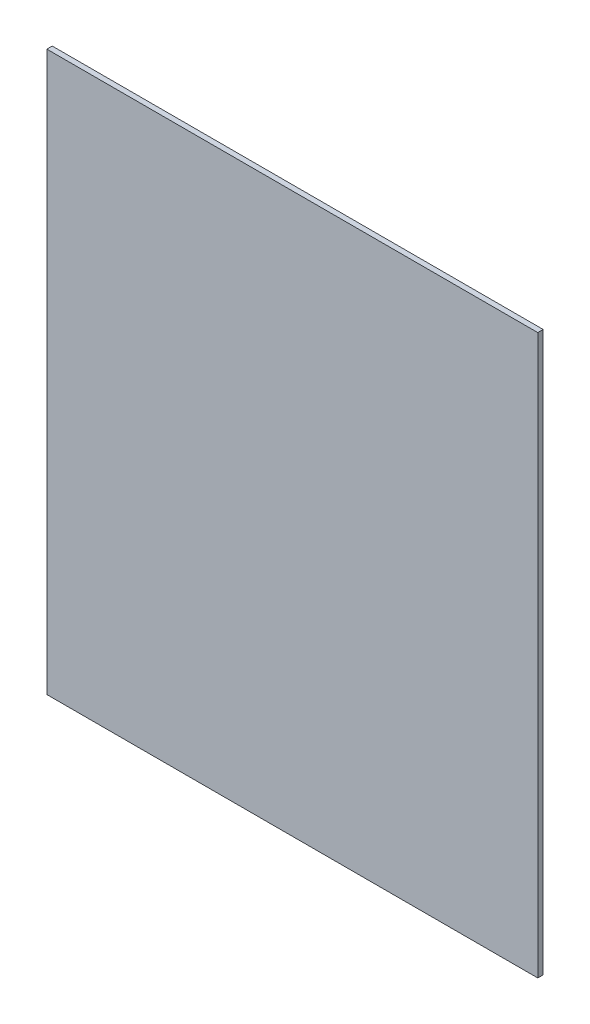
from build123d import *

# Parameters (mm, degrees)
SKETCH1_W      = 13.646
SKETCH1_H      = 15.536
EXTRUDE1_DEPTH = 0.15


with BuildPart() as part:
    # Sketch1 → Extrude1 (new body)
    with BuildSketch(Plane(origin=(0, 0, 0), x_dir=(-1, 0, 0), z_dir=(0, 0, -1))):
        Rectangle(SKETCH1_W, SKETCH1_H)
    extrude(amount=-EXTRUDE1_DEPTH)


solid = part.part
